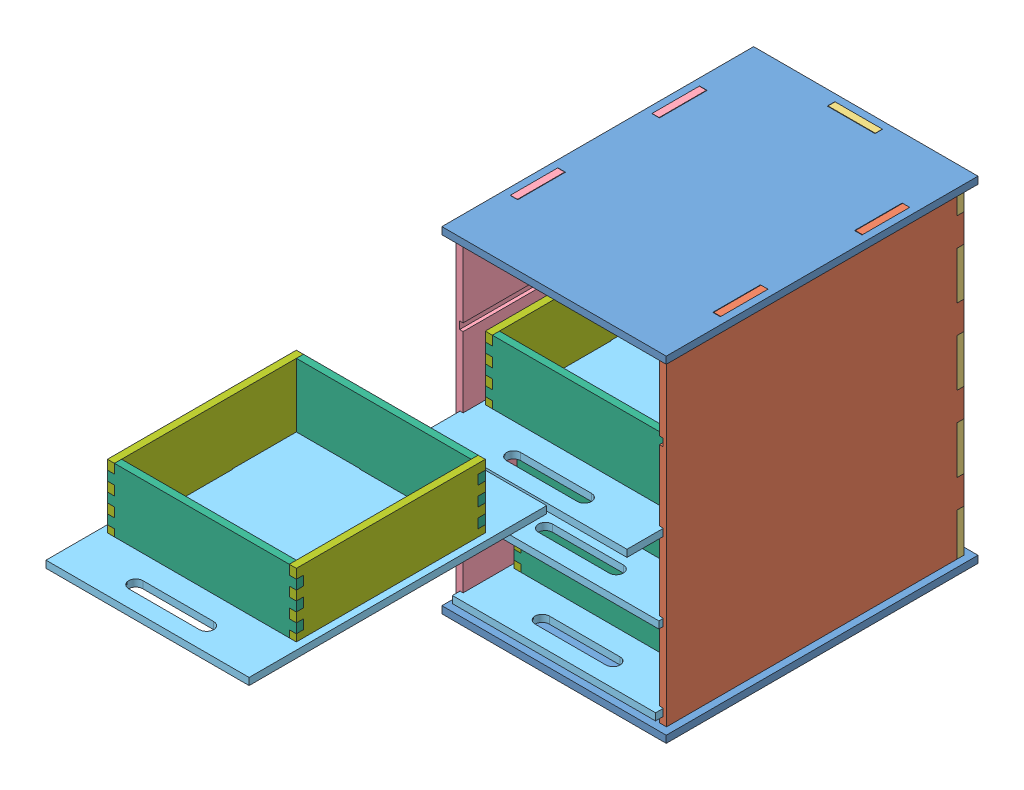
SolidWorks assembly final.SLDASM, configuration Predeterminado (file format 9000). Lengths in mm.
Overall size (475 710 1520.57).
30 component instances, 7 part files, 15 mates.
Components (placement in the parent):
- mueble-1: mueble.SLDASM [Predeterminado] at (-106.0749 -233.3111 320) size (475 710 660)
  - basemueble-1: basemueble.SLDPRT [Predeterminado] at (-73.579 -30.7201 500) size (475 15 660)
  - lateralmueble-5: lateralmueble.SLDPRT [Predeterminado] at (148.921 -30.7201 184.5) size (15 710 630)
  - basemueble-2: basemueble.SLDPRT [Predeterminado] at (-73.579 664.2799 500) size (475 15 660)
  - back-1: back.SLDPRT [Predeterminado] at (-73.579 324.2799 185) size (445 710 15)
  - lateralmueble2-2: lateralmueble2.SLDPRT [Predeterminado] at (-296.079 -30.7201 815) x (-1 0 0) z (0 0 -1) size (15 710 630)
- cajon-1: cajon.SLDASM [Predeterminado] at (-137.9808 -223.6593 535.1578) size (430 150 630)
  - basecajon-1: basecajon.SLDPRT [Predeterminado] at (-41.6731 -10.3719 300) size (430 15 630)
  - frontalcajon-1: frontalcajon.SLDPRT [Predeterminado] at (-41.6731 64.6281 485) size (400 150 15)
  - lateralcajon-1: lateralcajon.SLDPRT [Predeterminado] at (143.3269 64.6281 300) x (0 0 -1) z (1 0 0) size (400 150 15)
  - frontalcajon-2: frontalcajon.SLDPRT [Predeterminado] at (-41.6731 64.6281 100) size (400 150 15)
  - lateralcajon-2: lateralcajon.SLDPRT [Predeterminado] at (-226.6731 64.6281 300) x (0 0 1) z (-1 0 0) size (400 150 15)
- cajon-2: cajon.SLDASM [Predeterminado] at (-137.9808 106.3407 595.6397) size (430 150 630)
  - basecajon-1: basecajon.SLDPRT [Predeterminado] at (-41.6731 -10.3719 300) size (430 15 630)
  - frontalcajon-1: frontalcajon.SLDPRT [Predeterminado] at (-41.6731 64.6281 485) size (400 150 15)
  - lateralcajon-1: lateralcajon.SLDPRT [Predeterminado] at (143.3269 64.6281 300) x (0 0 -1) z (1 0 0) size (400 150 15)
  - frontalcajon-2: frontalcajon.SLDPRT [Predeterminado] at (-41.6731 64.6281 100) size (400 150 15)
  - lateralcajon-2: lateralcajon.SLDPRT [Predeterminado] at (-226.6731 64.6281 300) x (0 0 1) z (-1 0 0) size (400 150 15)
- cajon-3: cajon.SLDASM [Predeterminado] at (-137.9808 -58.6593 528.1971) size (430 150 630)
  - basecajon-1: basecajon.SLDPRT [Predeterminado] at (-41.6731 -10.3719 300) size (430 15 630)
  - frontalcajon-1: frontalcajon.SLDPRT [Predeterminado] at (-41.6731 64.6281 485) size (400 150 15)
  - lateralcajon-1: lateralcajon.SLDPRT [Predeterminado] at (143.3269 64.6281 300) x (0 0 -1) z (1 0 0) size (400 150 15)
  - frontalcajon-2: frontalcajon.SLDPRT [Predeterminado] at (-41.6731 64.6281 100) size (400 150 15)
  - lateralcajon-2: lateralcajon.SLDPRT [Predeterminado] at (-226.6731 64.6281 300) x (0 0 1) z (-1 0 0) size (400 150 15)
- cajon-4: cajon.SLDASM [Predeterminado] at (-137.9808 271.3407 1395.5743) size (430 150 630)
  - basecajon-1: basecajon.SLDPRT [Predeterminado] at (-41.6731 -10.3719 300) size (430 15 630)
  - frontalcajon-1: frontalcajon.SLDPRT [Predeterminado] at (-41.6731 64.6281 485) size (400 150 15)
  - lateralcajon-1: lateralcajon.SLDPRT [Predeterminado] at (143.3269 64.6281 300) x (0 0 -1) z (1 0 0) size (400 150 15)
  - frontalcajon-2: frontalcajon.SLDPRT [Predeterminado] at (-41.6731 64.6281 100) size (400 150 15)
  - lateralcajon-2: lateralcajon.SLDPRT [Predeterminado] at (-226.6731 64.6281 300) x (0 0 1) z (-1 0 0) size (400 150 15)
Mates (geometry in assembly coordinates):
- Ancho1: width anti-aligned: plane of cajon-1/basecajon-1 through (35.3461 -219.0312 1037.5408) normal (1 0 0); plane of cajon-1/basecajon-1 through (-394.6539 -219.0312 1037.5408) normal (-1 0 0); plane of mueble-1/lateralmueble-5 through (35.3461 -234.0312 1135) normal (-1 0 0); plane of mueble-1/lateralmueble2-2 through (-394.6539 -234.0312 505) normal (1 0 0)
- Coincidente1: coincident anti-aligned: plane of mueble-1/lateralmueble-5 through (27.8461 -234.0312 1134.5) normal (0 1 0); plane of cajon-1/basecajon-1 through (-179.6539 -234.0312 835.1578) normal (0 -1 0)
- Ancho2: width anti-aligned: plane of cajon-3/basecajon-1 through (-394.6539 -54.0312 648.5286) normal (-1 0 0); plane of cajon-3/basecajon-1 through (35.3461 -54.0312 648.5286) normal (1 0 0); plane of mueble-1/lateralmueble2-2 through (-387.1539 -53.0312 505) normal (1 0 0); plane of mueble-1/lateralmueble-5 through (27.8461 -53.0312 1135) normal (-1 0 0)
- Coincidente3: coincident anti-aligned: plane of mueble-1/lateralmueble2-2 through (-387.1539 -69.0312 505) normal (0 1 0); plane of cajon-3/basecajon-1 through (-179.6539 -69.0312 433.5286) normal (0 -1 0)
- Ancho3: width aligned: plane of cajon-2/basecajon-1 through (35.3461 110.9688 994.6295) normal (1 0 0); plane of cajon-2/basecajon-1 through (-394.6539 110.9688 994.6295) normal (-1 0 0); plane of mueble-1/lateralmueble2-2 through (-387.1539 111.9688 505) normal (1 0 0); plane of mueble-1/lateralmueble-5 through (27.8461 111.9688 1135) normal (-1 0 0)
- Coincidente4: coincident anti-aligned: plane of mueble-1/lateralmueble2-2 through (-387.1539 95.9688 505) normal (0 1 0); plane of cajon-2/basecajon-1 through (-179.6539 95.9688 779.6295) normal (0 -1 0)
- Ancho4: width anti-aligned: plane of cajon-4/basecajon-1 through (35.3461 275.9688 882.1758) normal (1 0 0); plane of cajon-4/basecajon-1 through (-394.6539 275.9688 882.1758) normal (-1 0 0); plane of mueble-1/lateralmueble-5 through (27.8461 276.9688 1135) normal (-1 0 0); plane of mueble-1/lateralmueble2-2 through (-387.1539 276.9688 505) normal (1 0 0)
- Coincidente5: coincident anti-aligned: plane of mueble-1/lateralmueble2-2 through (-387.1539 260.9688 505) normal (0 1 0); plane of cajon-4/basecajon-1 through (-179.6539 260.9688 667.1758) normal (0 -1 0)
- Ancho5: width aligned: plane of cajon-1/lateralcajon-1 through (20.3461 -159.0312 835.1578) normal (1 0 0); plane of cajon-1/lateralcajon-2 through (-379.6539 -159.0312 835.1578) normal (-1 0 0); plane of mueble-1/lateralmueble2-2 through (-387.1539 -218.0312 505) normal (1 0 0); plane of mueble-1/lateralmueble-5 through (27.8461 -218.0312 1134.5) normal (-1 0 0)
- Coincidente6: coincident anti-aligned: plane of mueble-1/lateralmueble-5 through (27.8461 -69.0312 1134.5) normal (0 1 0); plane of cajon-3/basecajon-1 through (-179.6539 -69.0312 828.1971) normal (0 -1 0)
- Coincidente7: coincident anti-aligned: plane of mueble-1/lateralmueble-5 through (27.8461 95.9688 1134.5) normal (0 1 0); plane of cajon-2/basecajon-1 through (-179.6539 95.9688 895.6397) normal (0 -1 0)
- Coincidente8: coincident anti-aligned: plane of mueble-1/lateralmueble-5 through (27.8461 260.9688 1134.5) normal (0 1 0); plane of cajon-4/basecajon-1 through (-179.6539 260.9688 1695.5743) normal (0 -1 0)
- Ancho6: width aligned: plane of cajon-4/lateralcajon-1 through (20.3461 335.9688 1695.5743) normal (1 0 0); plane of cajon-4/lateralcajon-2 through (-379.6539 335.9688 1695.5743) normal (-1 0 0); plane of mueble-1/lateralmueble2-2 through (-387.1539 276.9688 505) normal (1 0 0); plane of mueble-1/lateralmueble-5 through (27.8461 276.9688 1134.5) normal (-1 0 0)
- Ancho7: width anti-aligned: plane of cajon-2/lateralcajon-1 through (20.3461 170.9688 895.6397) normal (1 0 0); plane of cajon-2/lateralcajon-2 through (-379.6539 170.9688 895.6397) normal (-1 0 0); plane of mueble-1/lateralmueble-5 through (27.8461 111.9688 1134.5) normal (-1 0 0); plane of mueble-1/lateralmueble2-2 through (-387.1539 111.9688 505) normal (1 0 0)
- Ancho8: width aligned: plane of cajon-3/lateralcajon-1 through (20.3461 5.9688 828.1971) normal (1 0 0); plane of cajon-3/lateralcajon-2 through (-379.6539 5.9688 828.1971) normal (-1 0 0); plane of mueble-1/lateralmueble2-2 through (-387.1539 -53.0312 505) normal (1 0 0); plane of mueble-1/lateralmueble-5 through (27.8461 -53.0312 1134.5) normal (-1 0 0)
